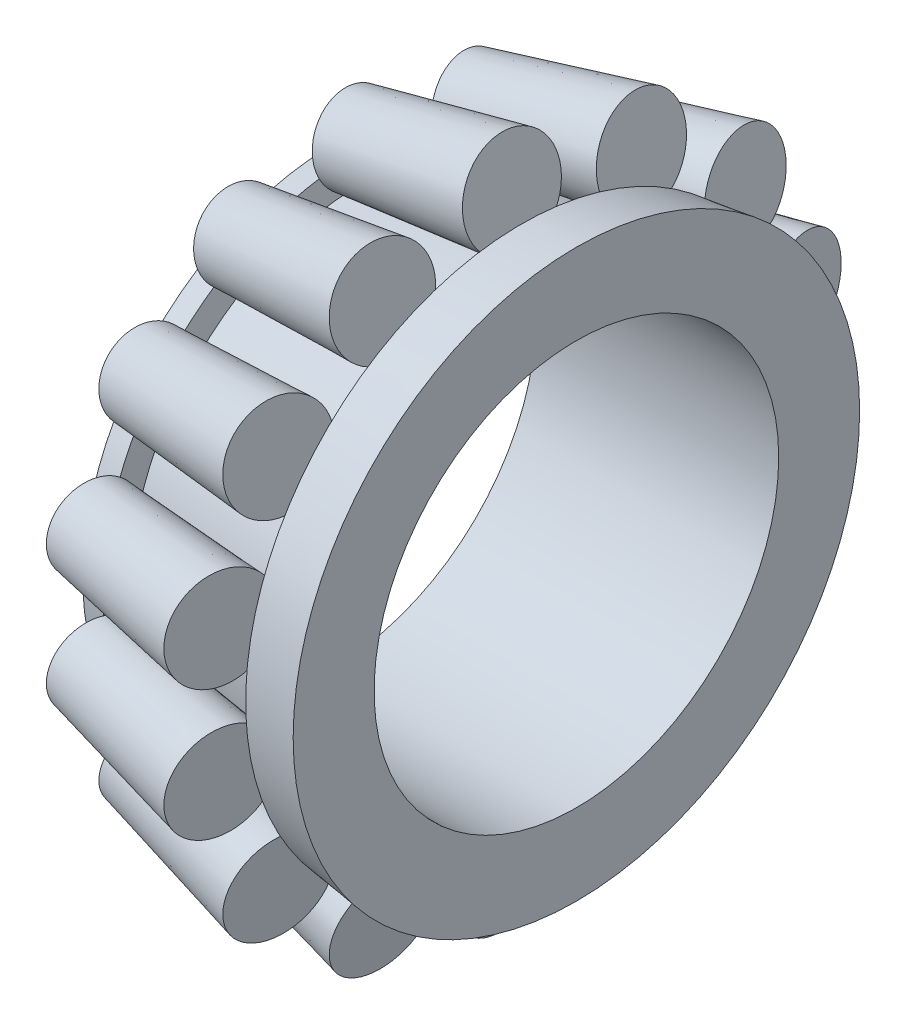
from build123d import *

# Parameters (mm, degrees)
R_P_TITION_CIRCULAIRE1_COUNT = 14


with BuildPart() as part:
    # Esquisse1 → Base-R_volution (revolve)
    with BuildSketch(Plane.XY, mode=Mode.PRIVATE) as base_r_volution_sk:
        Polygon((0, 12.5), (0, 17.5), (-3.386658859, 17.048445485), (-3.386658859, 15.53517089), (-13.311328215, 14.211881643), (-13.583905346, 15.688812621), (-15, 15.5), (-15, 12.5), align=None)
    revolve(base_r_volution_sk.sketch.rotate(Axis((40, 0, 0), (-1, 0, 0)), 90), axis=Axis((40, 0, 0), (-1, 0, 0)))

    # Esquisse2 → Boss.-R_vol.3 (revolve)
    with BuildSketch(Plane.XY):
        Polygon((-3.386658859, 15.5), (-13.272224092, 14), (-13.770369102, 16.450641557), (-3.98425159, 18.439878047), align=None)
    boss_r_vol_3 = revolve(axis=Axis((-3.98425159, 18.439878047, 0), (-0.9799593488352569, -0.1991975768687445, 0)))

    # R_p_tition circulaire1: Boss.-R_vol.3 ×14 about axis
    r_p_tition_circulaire1_axis = Axis((-10, 0, 0), (1, 0, 0))
    for i in range(1, R_P_TITION_CIRCULAIRE1_COUNT):
        add(boss_r_vol_3.rotate(r_p_tition_circulaire1_axis, i * 360 / R_P_TITION_CIRCULAIRE1_COUNT))


solid = part.part
